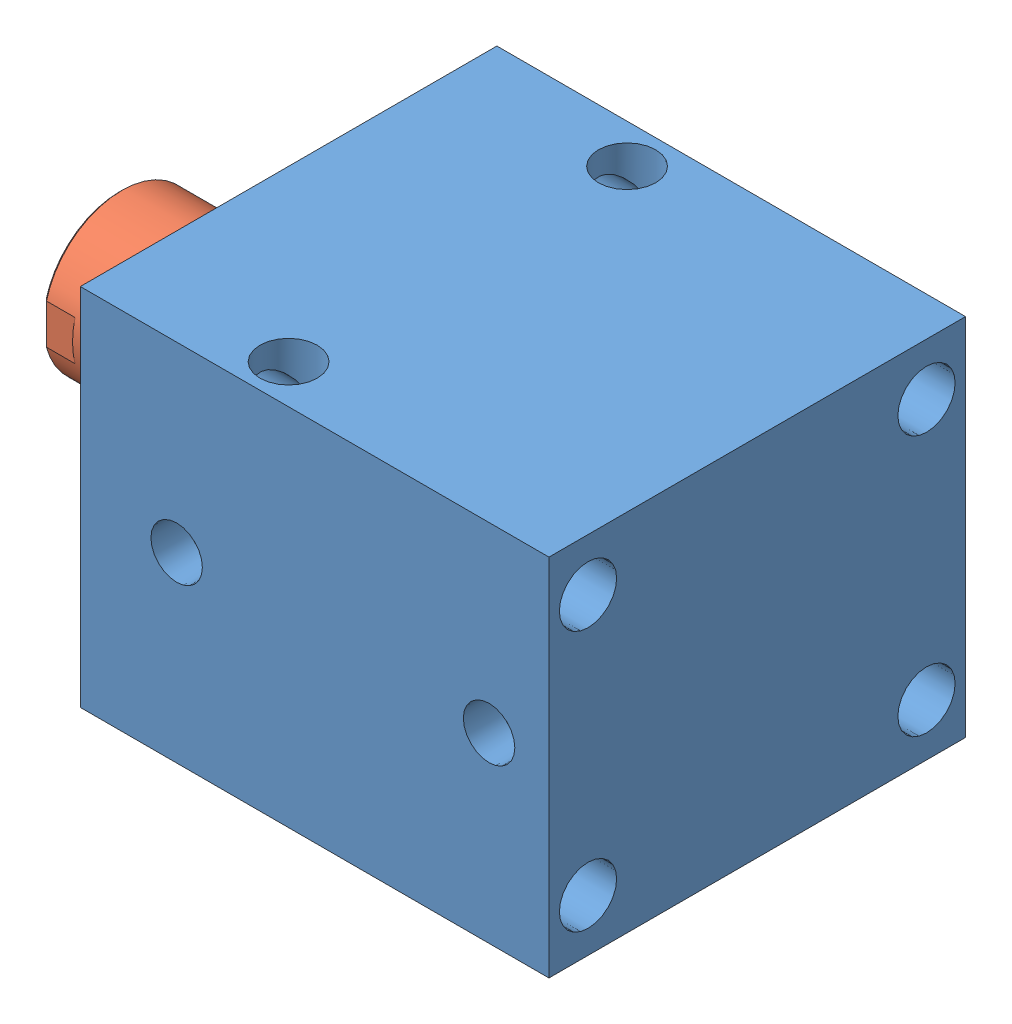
SolidWorks assembly 0902.SLDASM, configuration Default (file format 4400). Lengths in mm.
Overall size (245 140 160).
2 component instances, 2 part files, 3 mates.
Components (placement in the parent):
- 0901-1: 0901.SLDPRT [Default] at (19.6195 -62.1086 -36.0628) size (180 140 160)
- 0902-FP-1: 0902-FP.SLDPRT [Default] at (-135.3805 7.8914 -36.0628) x (0 0 1) z (-1 0 0) size (60 60 100)
Mates (geometry in assembly coordinates):
- Concentric1: concentric: cylinder of 0901-1 through (-10.3805 7.8914 -36.0628) axis (-1 0 0) radius 1.5; cylinder of 0902-FP-1 through (-20.3805 7.8914 -36.0628) axis (-1 0 0) radius 30
- Distance1: distance = 245 mm anti-aligned: plane of 0902-FP-1 through (-135.3805 7.8914 -36.0628) normal (-1 0 0); plane of 0901-1 through (109.6195 77.8914 -116.0628) normal (1 0 0)
- Parallel1: parallel: plane of 0901-1 through (-70.3805 77.8914 43.9372) normal (0 0 1); plane of 0902-FP-1 through (-120.3805 -2.6086 -7.0628) normal (0 0 1)
